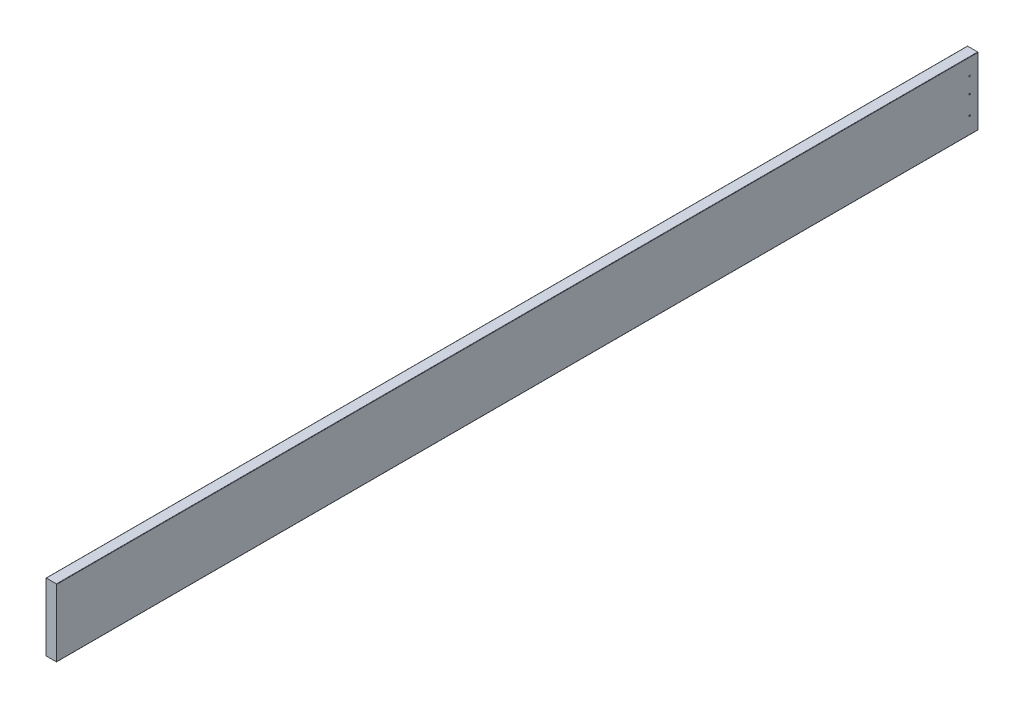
from build123d import *

# Parameters (mm, degrees)
SKETCH1_W          = 38.1
SKETCH1_H          = 241.3
EXTRUDE1_DEPTH     = 3289.3
FILLET1_R          = 1.27
SKETCH2_R          = 2.5
CUT_EXTRUDE1_DEPTH = 17.78
CUT_EXTRUDE2_START = -17.78
SKETCH3_R          = 2.5
CUT_EXTRUDE2_DEPTH = 17.78


with BuildPart() as part:
    # Sketch1 → Extrude1 (new body)
    with BuildSketch(Plane.XY):
        Rectangle(SKETCH1_W, SKETCH1_H)
    extrude(amount=EXTRUDE1_DEPTH)

    # Fillet1
    fillet1_edges = [part.edges().sort_by_distance(p)[0] for p in [
        (-19.05, 120.65, 1644.65),
        (19.05, 120.65, 1644.65),
        (19.05, -120.65, 1644.65),
        (-19.05, -120.65, 1644.65),
    ]]
    fillet(fillet1_edges, radius=FILLET1_R)

    # Sketch2 → Cut-Extrude1 (cut)
    with BuildSketch(Plane(origin=(19.05, 0, 0), x_dir=(0, 0, -1), z_dir=(1, 0, 0))):
        with Locations(Location((-30, -60.854239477, 0), (0, 0, 90))):
            Circle(SKETCH2_R)
        with Locations(Location((-30, 5.395760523, 0), (0, 0, 90))):
            Circle(SKETCH2_R)
        with Locations(Location((-30, 61.645760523, 0), (0, 0, 90))):
            Circle(SKETCH2_R)
    extrude(amount=-CUT_EXTRUDE1_DEPTH, mode=Mode.SUBTRACT)

    # Sketch3 → Cut-Extrude2 (cut)
    with BuildSketch(Plane.ZY.offset(19.05).offset(CUT_EXTRUDE2_START)):
        with Locations(Location((30, -60.854239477, 0), (0, 0, 90))):
            Circle(SKETCH3_R)
        with Locations(Location((30, 5.395760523, 0), (0, 0, 90))):
            Circle(SKETCH3_R)
        with Locations(Location((30, 61.645760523, 0), (0, 0, 90))):
            Circle(SKETCH3_R)
    extrude(amount=CUT_EXTRUDE2_DEPTH, mode=Mode.SUBTRACT)


solid = part.part
